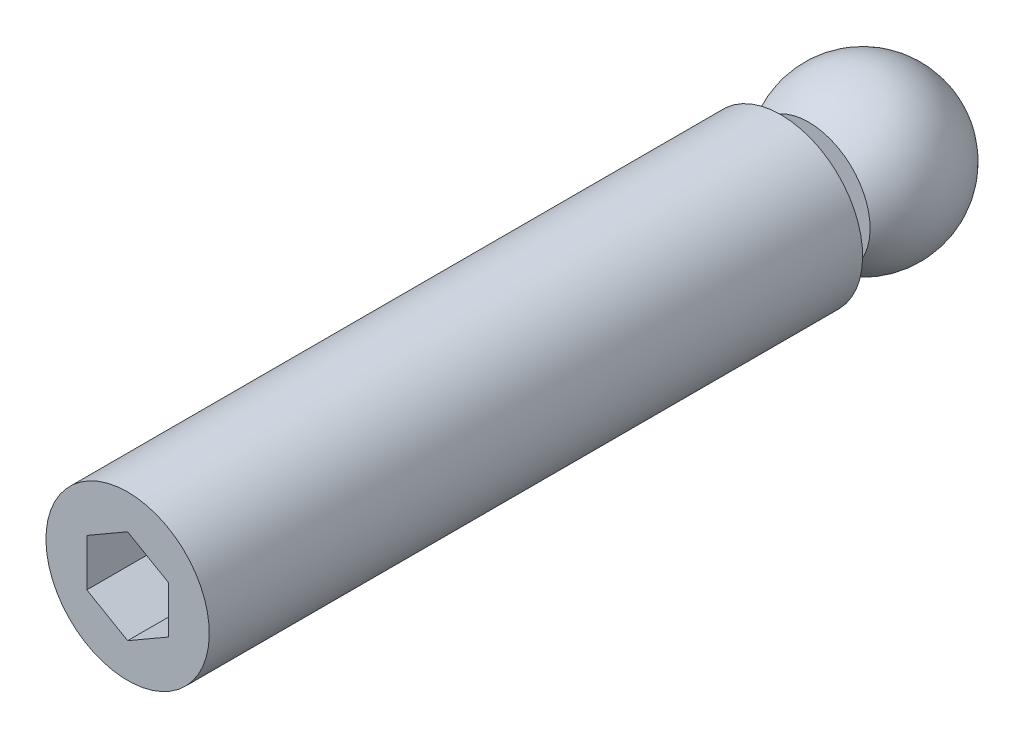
ISO-10303-21;
HEADER;
FILE_DESCRIPTION(('STEP AP214'),'2;1');
FILE_NAME('part.step','',(''),(''),'','','');
FILE_SCHEMA(('AUTOMOTIVE_DESIGN { 1 0 10303 214 1 1 1 1 }'));
ENDSEC;
DATA;
#1=APPLICATION_CONTEXT('core data for automotive mechanical design processes');
#2=APPLICATION_PROTOCOL_DEFINITION('international standard','automotive_design',2000,#1);
#3=PRODUCT_CONTEXT('',#1,'mechanical');
#4=PRODUCT('Part','Part','',(#3));
#5=PRODUCT_RELATED_PRODUCT_CATEGORY('part','',(#4));
#6=PRODUCT_DEFINITION_FORMATION('','',#4);
#7=PRODUCT_DEFINITION_CONTEXT('part definition',#1,'design');
#8=PRODUCT_DEFINITION('design','',#6,#7);
#9=PRODUCT_DEFINITION_SHAPE('','',#8);
#10=(LENGTH_UNIT() NAMED_UNIT(*) SI_UNIT(.MILLI.,.METRE.));
#11=(NAMED_UNIT(*) PLANE_ANGLE_UNIT() SI_UNIT($,.RADIAN.));
#12=(NAMED_UNIT(*) SI_UNIT($,.STERADIAN.) SOLID_ANGLE_UNIT());
#13=UNCERTAINTY_MEASURE_WITH_UNIT(LENGTH_MEASURE(1.E-05),#10,'distance_accuracy_value','');
#14=(GEOMETRIC_REPRESENTATION_CONTEXT(3) GLOBAL_UNCERTAINTY_ASSIGNED_CONTEXT((#13)) GLOBAL_UNIT_ASSIGNED_CONTEXT((#10,
#11,#12)) REPRESENTATION_CONTEXT('',''));
#15=CARTESIAN_POINT('',(0.,0.,0.));
#16=DIRECTION('',(0.,0.,1.));
#17=DIRECTION('',(1.,0.,0.));
#18=AXIS2_PLACEMENT_3D('',#15,#16,#17);
#19=CARTESIAN_POINT('',(0.,0.,5.));
#20=DIRECTION('',(0.,-1.,0.));
#21=DIRECTION('',(-1.,0.,0.));
#22=AXIS2_PLACEMENT_3D('',#19,#20,#21);
#23=SPHERICAL_SURFACE('',#22,5.);
#24=CARTESIAN_POINT('',(0.,0.,5.));
#25=DIRECTION('',(0.,0.,1.));
#26=DIRECTION('',(0.,1.,0.));
#27=AXIS2_PLACEMENT_3D('',#24,#25,#26);
#28=SPHERICAL_SURFACE('',#27,5.);
#29=CARTESIAN_POINT('',(0.,0.,8.3));
#30=DIRECTION('',(0.,0.,1.));
#31=DIRECTION('',(0.,1.,0.));
#32=AXIS2_PLACEMENT_3D('',#29,#30,#31);
#33=CIRCLE('',#32,3.75632799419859);
#34=CARTESIAN_POINT('',(0.,3.75632799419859,8.3));
#35=VERTEX_POINT('',#34);
#36=EDGE_CURVE('E9',#35,#35,#33,.T.);
#37=ORIENTED_EDGE('',*,*,#36,.F.);
#38=EDGE_LOOP('',(#37));
#39=FACE_BOUND('',#38,.T.);
#40=ADVANCED_FACE('F14',(#39),#28,.T.);
#41=CARTESIAN_POINT('',(0.,-3.75632799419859,8.3));
#42=DIRECTION('',(0.,0.,-1.));
#43=DIRECTION('',(0.,-1.,0.));
#44=AXIS2_PLACEMENT_3D('',#41,#42,#43);
#45=PLANE('',#44);
#46=CARTESIAN_POINT('',(0.,0.,8.3));
#47=DIRECTION('',(0.,0.,1.));
#48=DIRECTION('',(0.,1.,0.));
#49=AXIS2_PLACEMENT_3D('',#46,#47,#48);
#50=CIRCLE('',#49,2.5);
#51=CARTESIAN_POINT('',(0.,2.5,8.3));
#52=VERTEX_POINT('',#51);
#53=EDGE_CURVE('E21',#52,#52,#50,.T.);
#54=ORIENTED_EDGE('',*,*,#53,.F.);
#55=EDGE_LOOP('',(#54));
#56=FACE_BOUND('',#55,.T.);
#57=ORIENTED_EDGE('',*,*,#36,.T.);
#58=EDGE_LOOP('',(#57));
#59=FACE_BOUND('',#58,.T.);
#60=ADVANCED_FACE('F134',(#56,#59),#45,.F.);
#61=CARTESIAN_POINT('',(0.,0.,8.3));
#62=DIRECTION('',(0.,0.,1.));
#63=DIRECTION('',(0.,1.,0.));
#64=AXIS2_PLACEMENT_3D('',#61,#62,#63);
#65=CYLINDRICAL_SURFACE('',#64,2.5);
#66=ORIENTED_EDGE('',*,*,#53,.T.);
#67=EDGE_LOOP('',(#66));
#68=FACE_BOUND('',#67,.T.);
#69=CARTESIAN_POINT('',(0.,0.,10.));
#70=DIRECTION('',(0.,0.,1.));
#71=DIRECTION('',(0.,1.,0.));
#72=AXIS2_PLACEMENT_3D('',#69,#70,#71);
#73=CIRCLE('',#72,2.5);
#74=CARTESIAN_POINT('',(0.,2.5,10.));
#75=VERTEX_POINT('',#74);
#76=EDGE_CURVE('E126',#75,#75,#73,.T.);
#77=ORIENTED_EDGE('',*,*,#76,.F.);
#78=EDGE_LOOP('',(#77));
#79=FACE_BOUND('',#78,.T.);
#80=ADVANCED_FACE('F131',(#68,#79),#65,.T.);
#81=CARTESIAN_POINT('',(0.,-5.,10.));
#82=DIRECTION('',(0.,0.,-1.));
#83=DIRECTION('',(0.,-1.,0.));
#84=AXIS2_PLACEMENT_3D('',#81,#82,#83);
#85=PLANE('',#84);
#86=ORIENTED_EDGE('',*,*,#76,.T.);
#87=EDGE_LOOP('',(#86));
#88=FACE_BOUND('',#87,.T.);
#89=CARTESIAN_POINT('',(0.,0.,10.));
#90=DIRECTION('',(0.,0.,1.));
#91=DIRECTION('',(0.,1.,0.));
#92=AXIS2_PLACEMENT_3D('',#89,#90,#91);
#93=CIRCLE('',#92,5.);
#94=CARTESIAN_POINT('',(0.,5.,10.));
#95=VERTEX_POINT('',#94);
#96=EDGE_CURVE('E123',#95,#95,#93,.T.);
#97=ORIENTED_EDGE('',*,*,#96,.F.);
#98=EDGE_LOOP('',(#97));
#99=FACE_BOUND('',#98,.T.);
#100=ADVANCED_FACE('F157',(#88,#99),#85,.T.);
#101=CARTESIAN_POINT('',(0.,0.,8.3));
#102=DIRECTION('',(0.,0.,1.));
#103=DIRECTION('',(0.,1.,0.));
#104=AXIS2_PLACEMENT_3D('',#101,#102,#103);
#105=CYLINDRICAL_SURFACE('',#104,5.);
#106=ORIENTED_EDGE('',*,*,#96,.T.);
#107=EDGE_LOOP('',(#106));
#108=FACE_BOUND('',#107,.T.);
#109=CARTESIAN_POINT('',(0.,0.,50.));
#110=DIRECTION('',(0.,0.,1.));
#111=DIRECTION('',(0.,1.,0.));
#112=AXIS2_PLACEMENT_3D('',#109,#110,#111);
#113=CIRCLE('',#112,5.);
#114=CARTESIAN_POINT('',(0.,5.,50.));
#115=VERTEX_POINT('',#114);
#116=EDGE_CURVE('E115',#115,#115,#113,.T.);
#117=ORIENTED_EDGE('',*,*,#116,.F.);
#118=EDGE_LOOP('',(#117));
#119=FACE_BOUND('',#118,.T.);
#120=ADVANCED_FACE('F165',(#108,#119),#105,.T.);
#121=CARTESIAN_POINT('',(0.,0.,50.));
#122=DIRECTION('',(0.,0.,1.));
#123=DIRECTION('',(0.,1.,0.));
#124=AXIS2_PLACEMENT_3D('',#121,#122,#123);
#125=PLANE('',#124);
#126=DIRECTION('',(-0.866025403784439,0.5,0.));
#127=VECTOR('',#126,1.);
#128=CARTESIAN_POINT('',(2.5,1.44337567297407,50.));
#129=LINE('',#128,#127);
#130=CARTESIAN_POINT('',(2.5,1.44337567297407,50.));
#131=VERTEX_POINT('',#130);
#132=CARTESIAN_POINT('',(0.,2.88675134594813,50.));
#133=VERTEX_POINT('',#132);
#134=EDGE_CURVE('E28',#131,#133,#129,.T.);
#135=ORIENTED_EDGE('',*,*,#134,.F.);
#136=DIRECTION('',(0.,1.,0.));
#137=VECTOR('',#136,1.);
#138=CARTESIAN_POINT('',(2.5,-1.44337567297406,50.));
#139=LINE('',#138,#137);
#140=CARTESIAN_POINT('',(2.5,-1.44337567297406,50.));
#141=VERTEX_POINT('',#140);
#142=EDGE_CURVE('E111',#141,#131,#139,.T.);
#143=ORIENTED_EDGE('',*,*,#142,.F.);
#144=DIRECTION('',(0.866025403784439,0.5,0.));
#145=VECTOR('',#144,1.);
#146=CARTESIAN_POINT('',(0.,-2.88675134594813,50.));
#147=LINE('',#146,#145);
#148=CARTESIAN_POINT('',(0.,-2.88675134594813,50.));
#149=VERTEX_POINT('',#148);
#150=EDGE_CURVE('E109',#149,#141,#147,.T.);
#151=ORIENTED_EDGE('',*,*,#150,.F.);
#152=DIRECTION('',(0.866025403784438,-0.5,0.));
#153=VECTOR('',#152,1.);
#154=CARTESIAN_POINT('',(-2.5,-1.44337567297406,50.));
#155=LINE('',#154,#153);
#156=CARTESIAN_POINT('',(-2.5,-1.44337567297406,50.));
#157=VERTEX_POINT('',#156);
#158=EDGE_CURVE('E76',#157,#149,#155,.T.);
#159=ORIENTED_EDGE('',*,*,#158,.F.);
#160=DIRECTION('',(0.,-1.,0.));
#161=VECTOR('',#160,1.);
#162=CARTESIAN_POINT('',(-2.5,1.44337567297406,50.));
#163=LINE('',#162,#161);
#164=CARTESIAN_POINT('',(-2.5,1.44337567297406,50.));
#165=VERTEX_POINT('',#164);
#166=EDGE_CURVE('E105',#165,#157,#163,.T.);
#167=ORIENTED_EDGE('',*,*,#166,.F.);
#168=DIRECTION('',(-0.866025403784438,-0.5,0.));
#169=VECTOR('',#168,1.);
#170=CARTESIAN_POINT('',(0.,2.88675134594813,50.));
#171=LINE('',#170,#169);
#172=EDGE_CURVE('E102',#133,#165,#171,.T.);
#173=ORIENTED_EDGE('',*,*,#172,.F.);
#174=EDGE_LOOP('',(#135,#143,#151,#159,#167,#173));
#175=FACE_BOUND('',#174,.T.);
#176=ORIENTED_EDGE('',*,*,#116,.T.);
#177=EDGE_LOOP('',(#176));
#178=FACE_BOUND('',#177,.T.);
#179=ADVANCED_FACE('F174',(#175,#178),#125,.T.);
#180=CARTESIAN_POINT('',(2.5,1.44337567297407,44.));
#181=DIRECTION('',(0.5,0.866025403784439,0.));
#182=DIRECTION('',(-0.866025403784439,0.5,0.));
#183=AXIS2_PLACEMENT_3D('',#180,#181,#182);
#184=PLANE('',#183);
#185=ORIENTED_EDGE('',*,*,#134,.T.);
#186=DIRECTION('',(0.,0.,1.));
#187=VECTOR('',#186,1.);
#188=CARTESIAN_POINT('',(0.,2.88675134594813,44.));
#189=LINE('',#188,#187);
#190=CARTESIAN_POINT('',(0.,2.88675134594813,44.));
#191=VERTEX_POINT('',#190);
#192=EDGE_CURVE('E58',#191,#133,#189,.T.);
#193=ORIENTED_EDGE('',*,*,#192,.F.);
#194=DIRECTION('',(-0.866025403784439,0.5,0.));
#195=VECTOR('',#194,1.);
#196=CARTESIAN_POINT('',(2.5,1.44337567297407,44.));
#197=LINE('',#196,#195);
#198=CARTESIAN_POINT('',(2.5,1.44337567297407,44.));
#199=VERTEX_POINT('',#198);
#200=EDGE_CURVE('E113',#199,#191,#197,.T.);
#201=ORIENTED_EDGE('',*,*,#200,.F.);
#202=DIRECTION('',(0.,0.,1.));
#203=VECTOR('',#202,1.);
#204=CARTESIAN_POINT('',(2.5,1.44337567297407,44.));
#205=LINE('',#204,#203);
#206=EDGE_CURVE('E36',#199,#131,#205,.T.);
#207=ORIENTED_EDGE('',*,*,#206,.T.);
#208=EDGE_LOOP('',(#185,#193,#201,#207));
#209=FACE_BOUND('',#208,.T.);
#210=ADVANCED_FACE('F183',(#209),#184,.F.);
#211=CARTESIAN_POINT('',(2.5,-1.44337567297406,44.));
#212=DIRECTION('',(1.,0.,0.));
#213=DIRECTION('',(0.,0.,-1.));
#214=AXIS2_PLACEMENT_3D('',#211,#212,#213);
#215=PLANE('',#214);
#216=ORIENTED_EDGE('',*,*,#142,.T.);
#217=ORIENTED_EDGE('',*,*,#206,.F.);
#218=DIRECTION('',(0.,1.,0.));
#219=VECTOR('',#218,1.);
#220=CARTESIAN_POINT('',(2.5,-1.44337567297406,44.));
#221=LINE('',#220,#219);
#222=CARTESIAN_POINT('',(2.5,-1.44337567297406,44.));
#223=VERTEX_POINT('',#222);
#224=EDGE_CURVE('E88',#223,#199,#221,.T.);
#225=ORIENTED_EDGE('',*,*,#224,.F.);
#226=DIRECTION('',(0.,0.,1.));
#227=VECTOR('',#226,1.);
#228=CARTESIAN_POINT('',(2.5,-1.44337567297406,44.));
#229=LINE('',#228,#227);
#230=EDGE_CURVE('E80',#223,#141,#229,.T.);
#231=ORIENTED_EDGE('',*,*,#230,.T.);
#232=EDGE_LOOP('',(#216,#217,#225,#231));
#233=FACE_BOUND('',#232,.T.);
#234=ADVANCED_FACE('F192',(#233),#215,.F.);
#235=CARTESIAN_POINT('',(0.,-2.88675134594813,44.));
#236=DIRECTION('',(0.5,-0.866025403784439,0.));
#237=DIRECTION('',(0.866025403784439,0.5,0.));
#238=AXIS2_PLACEMENT_3D('',#235,#236,#237);
#239=PLANE('',#238);
#240=ORIENTED_EDGE('',*,*,#150,.T.);
#241=ORIENTED_EDGE('',*,*,#230,.F.);
#242=DIRECTION('',(0.866025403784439,0.5,0.));
#243=VECTOR('',#242,1.);
#244=CARTESIAN_POINT('',(0.,-2.88675134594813,44.));
#245=LINE('',#244,#243);
#246=CARTESIAN_POINT('',(0.,-2.88675134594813,44.));
#247=VERTEX_POINT('',#246);
#248=EDGE_CURVE('E84',#247,#223,#245,.T.);
#249=ORIENTED_EDGE('',*,*,#248,.F.);
#250=DIRECTION('',(0.,0.,1.));
#251=VECTOR('',#250,1.);
#252=CARTESIAN_POINT('',(0.,-2.88675134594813,44.));
#253=LINE('',#252,#251);
#254=EDGE_CURVE('E69',#247,#149,#253,.T.);
#255=ORIENTED_EDGE('',*,*,#254,.T.);
#256=EDGE_LOOP('',(#240,#241,#249,#255));
#257=FACE_BOUND('',#256,.T.);
#258=ADVANCED_FACE('F85',(#257),#239,.F.);
#259=CARTESIAN_POINT('',(-2.5,-1.44337567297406,44.));
#260=DIRECTION('',(-0.5,-0.866025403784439,0.));
#261=DIRECTION('',(0.866025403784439,-0.5,0.));
#262=AXIS2_PLACEMENT_3D('',#259,#260,#261);
#263=PLANE('',#262);
#264=ORIENTED_EDGE('',*,*,#158,.T.);
#265=ORIENTED_EDGE('',*,*,#254,.F.);
#266=DIRECTION('',(0.866025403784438,-0.5,0.));
#267=VECTOR('',#266,1.);
#268=CARTESIAN_POINT('',(-2.5,-1.44337567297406,44.));
#269=LINE('',#268,#267);
#270=CARTESIAN_POINT('',(-2.5,-1.44337567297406,44.));
#271=VERTEX_POINT('',#270);
#272=EDGE_CURVE('E73',#271,#247,#269,.T.);
#273=ORIENTED_EDGE('',*,*,#272,.F.);
#274=DIRECTION('',(0.,0.,1.));
#275=VECTOR('',#274,1.);
#276=CARTESIAN_POINT('',(-2.5,-1.44337567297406,44.));
#277=LINE('',#276,#275);
#278=EDGE_CURVE('E81',#271,#157,#277,.T.);
#279=ORIENTED_EDGE('',*,*,#278,.T.);
#280=EDGE_LOOP('',(#264,#265,#273,#279));
#281=FACE_BOUND('',#280,.T.);
#282=ADVANCED_FACE('F71',(#281),#263,.F.);
#283=CARTESIAN_POINT('',(-2.5,1.44337567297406,44.));
#284=DIRECTION('',(-1.,0.,0.));
#285=DIRECTION('',(0.,0.,1.));
#286=AXIS2_PLACEMENT_3D('',#283,#284,#285);
#287=PLANE('',#286);
#288=ORIENTED_EDGE('',*,*,#166,.T.);
#289=ORIENTED_EDGE('',*,*,#278,.F.);
#290=DIRECTION('',(0.,-1.,0.));
#291=VECTOR('',#290,1.);
#292=CARTESIAN_POINT('',(-2.5,1.44337567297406,44.));
#293=LINE('',#292,#291);
#294=CARTESIAN_POINT('',(-2.5,1.44337567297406,44.));
#295=VERTEX_POINT('',#294);
#296=EDGE_CURVE('E94',#295,#271,#293,.T.);
#297=ORIENTED_EDGE('',*,*,#296,.F.);
#298=DIRECTION('',(0.,0.,1.));
#299=VECTOR('',#298,1.);
#300=CARTESIAN_POINT('',(-2.5,1.44337567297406,44.));
#301=LINE('',#300,#299);
#302=EDGE_CURVE('E118',#295,#165,#301,.T.);
#303=ORIENTED_EDGE('',*,*,#302,.T.);
#304=EDGE_LOOP('',(#288,#289,#297,#303));
#305=FACE_BOUND('',#304,.T.);
#306=ADVANCED_FACE('F214',(#305),#287,.F.);
#307=CARTESIAN_POINT('',(0.,2.88675134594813,44.));
#308=DIRECTION('',(-0.5,0.866025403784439,0.));
#309=DIRECTION('',(-0.866025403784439,-0.5,0.));
#310=AXIS2_PLACEMENT_3D('',#307,#308,#309);
#311=PLANE('',#310);
#312=ORIENTED_EDGE('',*,*,#172,.T.);
#313=ORIENTED_EDGE('',*,*,#302,.F.);
#314=DIRECTION('',(-0.866025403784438,-0.5,0.));
#315=VECTOR('',#314,1.);
#316=CARTESIAN_POINT('',(0.,2.88675134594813,44.));
#317=LINE('',#316,#315);
#318=EDGE_CURVE('E96',#191,#295,#317,.T.);
#319=ORIENTED_EDGE('',*,*,#318,.F.);
#320=ORIENTED_EDGE('',*,*,#192,.T.);
#321=EDGE_LOOP('',(#312,#313,#319,#320));
#322=FACE_BOUND('',#321,.T.);
#323=ADVANCED_FACE('F222',(#322),#311,.F.);
#324=CARTESIAN_POINT('',(0.,2.88675134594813,44.));
#325=DIRECTION('',(0.,0.,1.));
#326=DIRECTION('',(1.,0.,0.));
#327=AXIS2_PLACEMENT_3D('',#324,#325,#326);
#328=PLANE('',#327);
#329=ORIENTED_EDGE('',*,*,#200,.T.);
#330=ORIENTED_EDGE('',*,*,#318,.T.);
#331=ORIENTED_EDGE('',*,*,#296,.T.);
#332=ORIENTED_EDGE('',*,*,#272,.T.);
#333=ORIENTED_EDGE('',*,*,#248,.T.);
#334=ORIENTED_EDGE('',*,*,#224,.T.);
#335=EDGE_LOOP('',(#329,#330,#331,#332,#333,#334));
#336=FACE_BOUND('',#335,.T.);
#337=ADVANCED_FACE('F91',(#336),#328,.T.);
#338=CLOSED_SHELL('',(#40,#60,#80,#100,#120,#179,#210,#234,#258,#282,#306,#323,#337));
#339=MANIFOLD_SOLID_BREP('B1',#338);
#340=ADVANCED_BREP_SHAPE_REPRESENTATION('',(#18,#339),#14);
#341=SHAPE_DEFINITION_REPRESENTATION(#9,#340);
ENDSEC;
END-ISO-10303-21;
